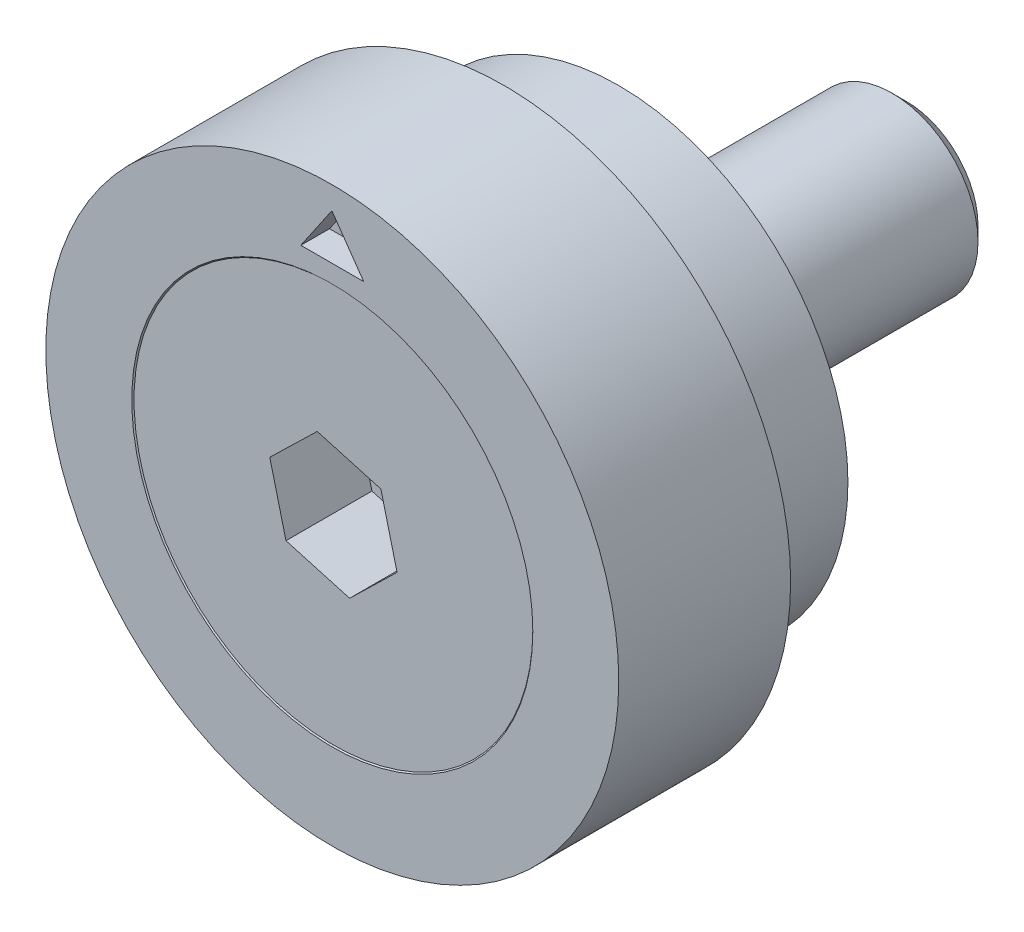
ISO-10303-21;
HEADER;
FILE_DESCRIPTION(('STEP AP214'),'2;1');
FILE_NAME('part.step','',(''),(''),'','','');
FILE_SCHEMA(('AUTOMOTIVE_DESIGN { 1 0 10303 214 1 1 1 1 }'));
ENDSEC;
DATA;
#1=APPLICATION_CONTEXT('core data for automotive mechanical design processes');
#2=APPLICATION_PROTOCOL_DEFINITION('international standard','automotive_design',2000,#1);
#3=PRODUCT_CONTEXT('',#1,'mechanical');
#4=PRODUCT('Part','Part','',(#3));
#5=PRODUCT_RELATED_PRODUCT_CATEGORY('part','',(#4));
#6=PRODUCT_DEFINITION_FORMATION('','',#4);
#7=PRODUCT_DEFINITION_CONTEXT('part definition',#1,'design');
#8=PRODUCT_DEFINITION('design','',#6,#7);
#9=PRODUCT_DEFINITION_SHAPE('','',#8);
#10=(LENGTH_UNIT() NAMED_UNIT(*) SI_UNIT(.MILLI.,.METRE.));
#11=(NAMED_UNIT(*) PLANE_ANGLE_UNIT() SI_UNIT($,.RADIAN.));
#12=(NAMED_UNIT(*) SI_UNIT($,.STERADIAN.) SOLID_ANGLE_UNIT());
#13=UNCERTAINTY_MEASURE_WITH_UNIT(LENGTH_MEASURE(1.E-05),#10,'distance_accuracy_value','');
#14=(GEOMETRIC_REPRESENTATION_CONTEXT(3) GLOBAL_UNCERTAINTY_ASSIGNED_CONTEXT((#13)) GLOBAL_UNIT_ASSIGNED_CONTEXT((#10,
#11,#12)) REPRESENTATION_CONTEXT('',''));
#15=CARTESIAN_POINT('',(0.,0.,0.));
#16=DIRECTION('',(0.,0.,1.));
#17=DIRECTION('',(1.,0.,0.));
#18=AXIS2_PLACEMENT_3D('',#15,#16,#17);
#19=CARTESIAN_POINT('',(0.,0.,-0.0200000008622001));
#20=DIRECTION('',(0.,0.,1.));
#21=DIRECTION('',(1.,0.,0.));
#22=AXIS2_PLACEMENT_3D('',#19,#20,#21);
#23=CYLINDRICAL_SURFACE('',#22,1.5);
#24=CARTESIAN_POINT('',(0.,0.,-2.0000000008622));
#25=DIRECTION('',(0.,0.,1.));
#26=DIRECTION('',(1.,0.,0.));
#27=AXIS2_PLACEMENT_3D('',#24,#25,#26);
#28=CIRCLE('',#27,1.5);
#29=CARTESIAN_POINT('',(1.5,0.,-2.0000000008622));
#30=VERTEX_POINT('',#29);
#31=EDGE_CURVE('P0_E11',#30,#30,#28,.T.);
#32=ORIENTED_EDGE('',*,*,#31,.F.);
#33=EDGE_LOOP('',(#32));
#34=FACE_BOUND('',#33,.T.);
#35=CARTESIAN_POINT('',(0.,0.,-9.7700000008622));
#36=DIRECTION('',(0.,0.,1.));
#37=DIRECTION('',(1.,0.,0.));
#38=AXIS2_PLACEMENT_3D('',#35,#36,#37);
#39=CIRCLE('',#38,1.5);
#40=CARTESIAN_POINT('',(1.5,0.,-9.7700000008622));
#41=VERTEX_POINT('',#40);
#42=EDGE_CURVE('P0_E136',#41,#41,#39,.T.);
#43=ORIENTED_EDGE('',*,*,#42,.T.);
#44=EDGE_LOOP('',(#43));
#45=FACE_BOUND('',#44,.T.);
#46=ADVANCED_FACE('P0_F35',(#34,#45),#23,.T.);
#47=CARTESIAN_POINT('',(0.,0.,-2.0000000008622));
#48=DIRECTION('',(0.,0.,1.));
#49=DIRECTION('',(1.,0.,0.));
#50=AXIS2_PLACEMENT_3D('',#47,#48,#49);
#51=CONICAL_SURFACE('',#50,1.5,0.785398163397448);
#52=CARTESIAN_POINT('',(0.,0.,-0.0200000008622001));
#53=DIRECTION('',(0.,0.,1.));
#54=DIRECTION('',(1.,0.,0.));
#55=AXIS2_PLACEMENT_3D('',#52,#53,#54);
#56=CIRCLE('',#55,3.48);
#57=CARTESIAN_POINT('',(3.48,0.,-0.0200000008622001));
#58=VERTEX_POINT('',#57);
#59=EDGE_CURVE('P0_E42',#58,#58,#56,.T.);
#60=ORIENTED_EDGE('',*,*,#59,.F.);
#61=EDGE_LOOP('',(#60));
#62=FACE_BOUND('',#61,.T.);
#63=ORIENTED_EDGE('',*,*,#31,.T.);
#64=EDGE_LOOP('',(#63));
#65=FACE_BOUND('',#64,.T.);
#66=ADVANCED_FACE('P0_F151',(#62,#65),#51,.T.);
#67=CARTESIAN_POINT('',(0.,3.48,-0.0200000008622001));
#68=DIRECTION('',(0.,0.,-1.));
#69=DIRECTION('',(-1.,0.,0.));
#70=AXIS2_PLACEMENT_3D('',#67,#68,#69);
#71=PLANE('',#70);
#72=DIRECTION('',(0.962144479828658,-0.272539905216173,0.));
#73=VECTOR('',#72,1.);
#74=CARTESIAN_POINT('',(-0.828034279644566,-0.804793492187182,-0.0200000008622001));
#75=LINE('',#74,#73);
#76=CARTESIAN_POINT('',(-0.828034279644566,-0.804793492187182,-0.0200000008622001));
#77=VERTEX_POINT('',#76);
#78=CARTESIAN_POINT('',(0.282954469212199,-1.11949546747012,-0.0200000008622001));
#79=VERTEX_POINT('',#78);
#80=EDGE_CURVE('P0_E123',#77,#79,#75,.T.);
#81=ORIENTED_EDGE('',*,*,#80,.F.);
#82=DIRECTION('',(0.245045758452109,-0.969511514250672,0.));
#83=VECTOR('',#82,1.);
#84=CARTESIAN_POINT('',(-1.11098874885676,0.314701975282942,-0.0200000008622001));
#85=LINE('',#84,#83);
#86=CARTESIAN_POINT('',(-1.11098874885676,0.314701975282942,-0.0200000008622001));
#87=VERTEX_POINT('',#86);
#88=EDGE_CURVE('P0_E49',#87,#77,#85,.T.);
#89=ORIENTED_EDGE('',*,*,#88,.F.);
#90=DIRECTION('',(-0.717098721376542,-0.696971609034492,0.));
#91=VECTOR('',#90,1.);
#92=CARTESIAN_POINT('',(-0.282954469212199,1.11949546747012,-0.0200000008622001));
#93=LINE('',#92,#91);
#94=CARTESIAN_POINT('',(-0.282954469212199,1.11949546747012,-0.0200000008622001));
#95=VERTEX_POINT('',#94);
#96=EDGE_CURVE('P0_E132',#95,#87,#93,.T.);
#97=ORIENTED_EDGE('',*,*,#96,.F.);
#98=DIRECTION('',(-0.962144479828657,0.272539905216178,0.));
#99=VECTOR('',#98,1.);
#100=CARTESIAN_POINT('',(0.828034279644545,0.804793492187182,-0.0200000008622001));
#101=LINE('',#100,#99);
#102=CARTESIAN_POINT('',(0.828034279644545,0.804793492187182,-0.0200000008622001));
#103=VERTEX_POINT('',#102);
#104=EDGE_CURVE('P0_E130',#103,#95,#101,.T.);
#105=ORIENTED_EDGE('',*,*,#104,.F.);
#106=DIRECTION('',(-0.245045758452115,0.96951151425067,0.));
#107=VECTOR('',#106,1.);
#108=CARTESIAN_POINT('',(1.11098874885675,-0.314701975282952,-0.0200000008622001));
#109=LINE('',#108,#107);
#110=CARTESIAN_POINT('',(1.11098874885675,-0.314701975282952,-0.0200000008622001));
#111=VERTEX_POINT('',#110);
#112=EDGE_CURVE('P0_E97',#111,#103,#109,.T.);
#113=ORIENTED_EDGE('',*,*,#112,.F.);
#114=DIRECTION('',(0.717098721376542,0.696971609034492,0.));
#115=VECTOR('',#114,1.);
#116=CARTESIAN_POINT('',(0.282954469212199,-1.11949546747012,-0.0200000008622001));
#117=LINE('',#116,#115);
#118=EDGE_CURVE('P0_E126',#79,#111,#117,.T.);
#119=ORIENTED_EDGE('',*,*,#118,.F.);
#120=EDGE_LOOP('',(#81,#89,#97,#105,#113,#119));
#121=FACE_BOUND('',#120,.T.);
#122=ORIENTED_EDGE('',*,*,#59,.T.);
#123=EDGE_LOOP('',(#122));
#124=FACE_BOUND('',#123,.T.);
#125=ADVANCED_FACE('P0_F149',(#121,#124),#71,.F.);
#126=CARTESIAN_POINT('',(0.,0.,-10.0200000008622));
#127=DIRECTION('',(0.,0.,1.));
#128=DIRECTION('',(1.,0.,0.));
#129=AXIS2_PLACEMENT_3D('',#126,#127,#128);
#130=PLANE('',#129);
#131=CARTESIAN_POINT('',(0.,0.,-10.0200000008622));
#132=DIRECTION('',(0.,0.,1.));
#133=DIRECTION('',(1.,0.,0.));
#134=AXIS2_PLACEMENT_3D('',#131,#132,#133);
#135=CIRCLE('',#134,1.25);
#136=CARTESIAN_POINT('',(1.25,0.,-10.0200000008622));
#137=VERTEX_POINT('',#136);
#138=EDGE_CURVE('P0_E144',#137,#137,#135,.T.);
#139=ORIENTED_EDGE('',*,*,#138,.F.);
#140=EDGE_LOOP('',(#139));
#141=FACE_BOUND('',#140,.T.);
#142=ADVANCED_FACE('P0_F164',(#141),#130,.F.);
#143=CARTESIAN_POINT('',(0.,0.,-10.0200000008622));
#144=DIRECTION('',(0.,0.,1.));
#145=DIRECTION('',(1.,0.,0.));
#146=AXIS2_PLACEMENT_3D('',#143,#144,#145);
#147=CONICAL_SURFACE('',#146,1.25,0.78539816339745);
#148=ORIENTED_EDGE('',*,*,#42,.F.);
#149=EDGE_LOOP('',(#148));
#150=FACE_BOUND('',#149,.T.);
#151=ORIENTED_EDGE('',*,*,#138,.T.);
#152=EDGE_LOOP('',(#151));
#153=FACE_BOUND('',#152,.T.);
#154=ADVANCED_FACE('P0_F160',(#150,#153),#147,.T.);
#155=CARTESIAN_POINT('',(-1.11098874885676,0.314701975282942,-1.5200000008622));
#156=DIRECTION('',(-0.969511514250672,-0.245045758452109,0.));
#157=DIRECTION('',(0.245045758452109,-0.969511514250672,0.));
#158=AXIS2_PLACEMENT_3D('',#155,#156,#157);
#159=PLANE('',#158);
#160=ORIENTED_EDGE('',*,*,#88,.T.);
#161=DIRECTION('',(0.,0.,1.));
#162=VECTOR('',#161,1.);
#163=CARTESIAN_POINT('',(-0.828034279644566,-0.804793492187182,-1.5200000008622));
#164=LINE('',#163,#162);
#165=CARTESIAN_POINT('',(-0.828034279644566,-0.804793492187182,-1.5200000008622));
#166=VERTEX_POINT('',#165);
#167=EDGE_CURVE('P0_E79',#166,#77,#164,.T.);
#168=ORIENTED_EDGE('',*,*,#167,.F.);
#169=DIRECTION('',(0.245045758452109,-0.969511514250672,0.));
#170=VECTOR('',#169,1.);
#171=CARTESIAN_POINT('',(-1.11098874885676,0.314701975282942,-1.5200000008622));
#172=LINE('',#171,#170);
#173=CARTESIAN_POINT('',(-1.11098874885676,0.314701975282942,-1.5200000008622));
#174=VERTEX_POINT('',#173);
#175=EDGE_CURVE('P0_E134',#174,#166,#172,.T.);
#176=ORIENTED_EDGE('',*,*,#175,.F.);
#177=DIRECTION('',(0.,0.,1.));
#178=VECTOR('',#177,1.);
#179=CARTESIAN_POINT('',(-1.11098874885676,0.314701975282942,-1.5200000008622));
#180=LINE('',#179,#178);
#181=EDGE_CURVE('P0_E57',#174,#87,#180,.T.);
#182=ORIENTED_EDGE('',*,*,#181,.T.);
#183=EDGE_LOOP('',(#160,#168,#176,#182));
#184=FACE_BOUND('',#183,.T.);
#185=ADVANCED_FACE('P0_F163',(#184),#159,.F.);
#186=CARTESIAN_POINT('',(-0.282954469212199,1.11949546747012,-1.5200000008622));
#187=DIRECTION('',(-0.696971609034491,0.717098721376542,0.));
#188=DIRECTION('',(-0.717098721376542,-0.696971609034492,0.));
#189=AXIS2_PLACEMENT_3D('',#186,#187,#188);
#190=PLANE('',#189);
#191=ORIENTED_EDGE('',*,*,#96,.T.);
#192=ORIENTED_EDGE('',*,*,#181,.F.);
#193=DIRECTION('',(-0.717098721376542,-0.696971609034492,0.));
#194=VECTOR('',#193,1.);
#195=CARTESIAN_POINT('',(-0.282954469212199,1.11949546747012,-1.5200000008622));
#196=LINE('',#195,#194);
#197=CARTESIAN_POINT('',(-0.282954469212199,1.11949546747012,-1.5200000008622));
#198=VERTEX_POINT('',#197);
#199=EDGE_CURVE('P0_E109',#198,#174,#196,.T.);
#200=ORIENTED_EDGE('',*,*,#199,.F.);
#201=DIRECTION('',(0.,0.,1.));
#202=VECTOR('',#201,1.);
#203=CARTESIAN_POINT('',(-0.282954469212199,1.11949546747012,-1.5200000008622));
#204=LINE('',#203,#202);
#205=EDGE_CURVE('P0_E101',#198,#95,#204,.T.);
#206=ORIENTED_EDGE('',*,*,#205,.T.);
#207=EDGE_LOOP('',(#191,#192,#200,#206));
#208=FACE_BOUND('',#207,.T.);
#209=ADVANCED_FACE('P0_F178',(#208),#190,.F.);
#210=CARTESIAN_POINT('',(0.828034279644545,0.804793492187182,-1.5200000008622));
#211=DIRECTION('',(0.272539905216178,0.962144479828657,0.));
#212=DIRECTION('',(-0.962144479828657,0.272539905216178,0.));
#213=AXIS2_PLACEMENT_3D('',#210,#211,#212);
#214=PLANE('',#213);
#215=ORIENTED_EDGE('',*,*,#104,.T.);
#216=ORIENTED_EDGE('',*,*,#205,.F.);
#217=DIRECTION('',(-0.962144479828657,0.272539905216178,0.));
#218=VECTOR('',#217,1.);
#219=CARTESIAN_POINT('',(0.828034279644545,0.804793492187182,-1.5200000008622));
#220=LINE('',#219,#218);
#221=CARTESIAN_POINT('',(0.828034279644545,0.804793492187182,-1.5200000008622));
#222=VERTEX_POINT('',#221);
#223=EDGE_CURVE('P0_E105',#222,#198,#220,.T.);
#224=ORIENTED_EDGE('',*,*,#223,.F.);
#225=DIRECTION('',(0.,0.,1.));
#226=VECTOR('',#225,1.);
#227=CARTESIAN_POINT('',(0.828034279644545,0.804793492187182,-1.5200000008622));
#228=LINE('',#227,#226);
#229=EDGE_CURVE('P0_E90',#222,#103,#228,.T.);
#230=ORIENTED_EDGE('',*,*,#229,.T.);
#231=EDGE_LOOP('',(#215,#216,#224,#230));
#232=FACE_BOUND('',#231,.T.);
#233=ADVANCED_FACE('P0_F106',(#232),#214,.F.);
#234=CARTESIAN_POINT('',(1.11098874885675,-0.314701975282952,-1.5200000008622));
#235=DIRECTION('',(0.96951151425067,0.245045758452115,0.));
#236=DIRECTION('',(-0.245045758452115,0.96951151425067,0.));
#237=AXIS2_PLACEMENT_3D('',#234,#235,#236);
#238=PLANE('',#237);
#239=ORIENTED_EDGE('',*,*,#112,.T.);
#240=ORIENTED_EDGE('',*,*,#229,.F.);
#241=DIRECTION('',(-0.245045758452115,0.96951151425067,0.));
#242=VECTOR('',#241,1.);
#243=CARTESIAN_POINT('',(1.11098874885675,-0.314701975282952,-1.5200000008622));
#244=LINE('',#243,#242);
#245=CARTESIAN_POINT('',(1.11098874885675,-0.314701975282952,-1.5200000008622));
#246=VERTEX_POINT('',#245);
#247=EDGE_CURVE('P0_E94',#246,#222,#244,.T.);
#248=ORIENTED_EDGE('',*,*,#247,.F.);
#249=DIRECTION('',(0.,0.,1.));
#250=VECTOR('',#249,1.);
#251=CARTESIAN_POINT('',(1.11098874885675,-0.314701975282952,-1.5200000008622));
#252=LINE('',#251,#250);
#253=EDGE_CURVE('P0_E102',#246,#111,#252,.T.);
#254=ORIENTED_EDGE('',*,*,#253,.T.);
#255=EDGE_LOOP('',(#239,#240,#248,#254));
#256=FACE_BOUND('',#255,.T.);
#257=ADVANCED_FACE('P0_F92',(#256),#238,.F.);
#258=CARTESIAN_POINT('',(0.282954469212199,-1.11949546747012,-1.5200000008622));
#259=DIRECTION('',(0.696971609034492,-0.717098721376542,0.));
#260=DIRECTION('',(0.717098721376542,0.696971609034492,0.));
#261=AXIS2_PLACEMENT_3D('',#258,#259,#260);
#262=PLANE('',#261);
#263=ORIENTED_EDGE('',*,*,#118,.T.);
#264=ORIENTED_EDGE('',*,*,#253,.F.);
#265=DIRECTION('',(0.717098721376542,0.696971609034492,0.));
#266=VECTOR('',#265,1.);
#267=CARTESIAN_POINT('',(0.282954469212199,-1.11949546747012,-1.5200000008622));
#268=LINE('',#267,#266);
#269=CARTESIAN_POINT('',(0.282954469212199,-1.11949546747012,-1.5200000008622));
#270=VERTEX_POINT('',#269);
#271=EDGE_CURVE('P0_E115',#270,#246,#268,.T.);
#272=ORIENTED_EDGE('',*,*,#271,.F.);
#273=DIRECTION('',(0.,0.,1.));
#274=VECTOR('',#273,1.);
#275=CARTESIAN_POINT('',(0.282954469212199,-1.11949546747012,-1.5200000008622));
#276=LINE('',#275,#274);
#277=EDGE_CURVE('P0_E139',#270,#79,#276,.T.);
#278=ORIENTED_EDGE('',*,*,#277,.T.);
#279=EDGE_LOOP('',(#263,#264,#272,#278));
#280=FACE_BOUND('',#279,.T.);
#281=ADVANCED_FACE('P0_F182',(#280),#262,.F.);
#282=CARTESIAN_POINT('',(-0.828034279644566,-0.804793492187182,-1.5200000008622));
#283=DIRECTION('',(-0.272539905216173,-0.962144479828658,0.));
#284=DIRECTION('',(0.962144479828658,-0.272539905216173,0.));
#285=AXIS2_PLACEMENT_3D('',#282,#283,#284);
#286=PLANE('',#285);
#287=ORIENTED_EDGE('',*,*,#80,.T.);
#288=ORIENTED_EDGE('',*,*,#277,.F.);
#289=DIRECTION('',(0.962144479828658,-0.272539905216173,0.));
#290=VECTOR('',#289,1.);
#291=CARTESIAN_POINT('',(-0.828034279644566,-0.804793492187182,-1.5200000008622));
#292=LINE('',#291,#290);
#293=EDGE_CURVE('P0_E117',#166,#270,#292,.T.);
#294=ORIENTED_EDGE('',*,*,#293,.F.);
#295=ORIENTED_EDGE('',*,*,#167,.T.);
#296=EDGE_LOOP('',(#287,#288,#294,#295));
#297=FACE_BOUND('',#296,.T.);
#298=ADVANCED_FACE('P0_F179',(#297),#286,.F.);
#299=CARTESIAN_POINT('',(0.,0.,-1.5200000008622));
#300=DIRECTION('',(0.,0.,1.));
#301=DIRECTION('',(1.,0.,0.));
#302=AXIS2_PLACEMENT_3D('',#299,#300,#301);
#303=PLANE('',#302);
#304=ORIENTED_EDGE('',*,*,#175,.T.);
#305=ORIENTED_EDGE('',*,*,#293,.T.);
#306=ORIENTED_EDGE('',*,*,#271,.T.);
#307=ORIENTED_EDGE('',*,*,#247,.T.);
#308=ORIENTED_EDGE('',*,*,#223,.T.);
#309=ORIENTED_EDGE('',*,*,#199,.T.);
#310=EDGE_LOOP('',(#304,#305,#306,#307,#308,#309));
#311=FACE_BOUND('',#310,.T.);
#312=ADVANCED_FACE('P0_F112',(#311),#303,.T.);
#313=CLOSED_SHELL('',(#46,#66,#125,#142,#154,#185,#209,#233,#257,#281,#298,#312));
#314=MANIFOLD_SOLID_BREP('P0_B2',#313);
#315=CARTESIAN_POINT('',(0.,0.,3.12219627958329));
#316=DIRECTION('',(0.,0.,1.));
#317=DIRECTION('',(1.,0.,0.));
#318=AXIS2_PLACEMENT_3D('',#315,#316,#317);
#319=CYLINDRICAL_SURFACE('',#318,5.);
#320=CARTESIAN_POINT('',(0.,0.,0.));
#321=DIRECTION('',(0.,0.,1.));
#322=DIRECTION('',(1.,0.,0.));
#323=AXIS2_PLACEMENT_3D('',#320,#321,#322);
#324=CIRCLE('',#323,5.);
#325=CARTESIAN_POINT('',(5.,0.,0.));
#326=VERTEX_POINT('',#325);
#327=EDGE_CURVE('P1_E11',#326,#326,#324,.T.);
#328=ORIENTED_EDGE('',*,*,#327,.F.);
#329=EDGE_LOOP('',(#328));
#330=FACE_BOUND('',#329,.T.);
#331=CARTESIAN_POINT('',(0.,0.,-3.));
#332=DIRECTION('',(0.,0.,1.));
#333=DIRECTION('',(1.,0.,0.));
#334=AXIS2_PLACEMENT_3D('',#331,#332,#333);
#335=CIRCLE('',#334,5.);
#336=CARTESIAN_POINT('',(5.,0.,-3.));
#337=VERTEX_POINT('',#336);
#338=EDGE_CURVE('P1_E75',#337,#337,#335,.T.);
#339=ORIENTED_EDGE('',*,*,#338,.T.);
#340=EDGE_LOOP('',(#339));
#341=FACE_BOUND('',#340,.T.);
#342=ADVANCED_FACE('P1_F16',(#330,#341),#319,.T.);
#343=CARTESIAN_POINT('',(0.,5.,0.));
#344=DIRECTION('',(0.,0.,-1.));
#345=DIRECTION('',(-1.,0.,0.));
#346=AXIS2_PLACEMENT_3D('',#343,#344,#345);
#347=PLANE('',#346);
#348=DIRECTION('',(-0.573576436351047,0.819152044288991,0.));
#349=VECTOR('',#348,1.);
#350=CARTESIAN_POINT('',(0.548658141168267,3.81,0.));
#351=LINE('',#350,#349);
#352=CARTESIAN_POINT('',(0.548658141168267,3.81,0.));
#353=VERTEX_POINT('',#352);
#354=CARTESIAN_POINT('',(-0.00713159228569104,4.60375,0.));
#355=VERTEX_POINT('',#354);
#356=EDGE_CURVE('P1_E68',#353,#355,#351,.T.);
#357=ORIENTED_EDGE('',*,*,#356,.F.);
#358=DIRECTION('',(1.,0.,0.));
#359=VECTOR('',#358,1.);
#360=CARTESIAN_POINT('',(-0.548658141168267,3.81,0.));
#361=LINE('',#360,#359);
#362=CARTESIAN_POINT('',(-0.548658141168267,3.81,0.));
#363=VERTEX_POINT('',#362);
#364=EDGE_CURVE('P1_E30',#363,#353,#361,.T.);
#365=ORIENTED_EDGE('',*,*,#364,.F.);
#366=DIRECTION('',(-0.563573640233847,-0.826065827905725,0.));
#367=VECTOR('',#366,1.);
#368=CARTESIAN_POINT('',(-0.00713159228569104,4.60375,0.));
#369=LINE('',#368,#367);
#370=EDGE_CURVE('P1_E66',#355,#363,#369,.T.);
#371=ORIENTED_EDGE('',*,*,#370,.F.);
#372=EDGE_LOOP('',(#357,#365,#371));
#373=FACE_BOUND('',#372,.T.);
#374=CARTESIAN_POINT('',(0.,0.,0.));
#375=DIRECTION('',(0.,0.,1.));
#376=DIRECTION('',(1.,0.,0.));
#377=AXIS2_PLACEMENT_3D('',#374,#375,#376);
#378=CIRCLE('',#377,3.5000000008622);
#379=CARTESIAN_POINT('',(3.5000000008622,0.,0.));
#380=VERTEX_POINT('',#379);
#381=EDGE_CURVE('P1_E23',#380,#380,#378,.T.);
#382=ORIENTED_EDGE('',*,*,#381,.F.);
#383=EDGE_LOOP('',(#382));
#384=FACE_BOUND('',#383,.T.);
#385=ORIENTED_EDGE('',*,*,#327,.T.);
#386=EDGE_LOOP('',(#385));
#387=FACE_BOUND('',#386,.T.);
#388=ADVANCED_FACE('P1_F95',(#373,#384,#387),#347,.F.);
#389=CARTESIAN_POINT('',(0.,0.,0.));
#390=DIRECTION('',(0.,0.,1.));
#391=DIRECTION('',(1.,0.,0.));
#392=AXIS2_PLACEMENT_3D('',#389,#390,#391);
#393=CONICAL_SURFACE('',#392,3.5000000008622,0.785398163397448);
#394=CARTESIAN_POINT('',(0.,0.,-2.0000000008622));
#395=DIRECTION('',(0.,0.,1.));
#396=DIRECTION('',(1.,0.,0.));
#397=AXIS2_PLACEMENT_3D('',#394,#395,#396);
#398=CIRCLE('',#397,1.5);
#399=CARTESIAN_POINT('',(1.5,0.,-2.0000000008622));
#400=VERTEX_POINT('',#399);
#401=EDGE_CURVE('P1_E88',#400,#400,#398,.T.);
#402=ORIENTED_EDGE('',*,*,#401,.F.);
#403=EDGE_LOOP('',(#402));
#404=FACE_BOUND('',#403,.T.);
#405=ORIENTED_EDGE('',*,*,#381,.T.);
#406=EDGE_LOOP('',(#405));
#407=FACE_BOUND('',#406,.T.);
#408=ADVANCED_FACE('P1_F93',(#404,#407),#393,.F.);
#409=CARTESIAN_POINT('',(0.,0.,3.12219627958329));
#410=DIRECTION('',(0.,0.,1.));
#411=DIRECTION('',(1.,0.,0.));
#412=AXIS2_PLACEMENT_3D('',#409,#410,#411);
#413=CYLINDRICAL_SURFACE('',#412,1.5);
#414=CARTESIAN_POINT('',(0.,0.,-5.));
#415=DIRECTION('',(0.,0.,1.));
#416=DIRECTION('',(1.,0.,0.));
#417=AXIS2_PLACEMENT_3D('',#414,#415,#416);
#418=CIRCLE('',#417,1.5);
#419=CARTESIAN_POINT('',(1.5,0.,-5.));
#420=VERTEX_POINT('',#419);
#421=EDGE_CURVE('P1_E85',#420,#420,#418,.T.);
#422=ORIENTED_EDGE('',*,*,#421,.F.);
#423=EDGE_LOOP('',(#422));
#424=FACE_BOUND('',#423,.T.);
#425=ORIENTED_EDGE('',*,*,#401,.T.);
#426=EDGE_LOOP('',(#425));
#427=FACE_BOUND('',#426,.T.);
#428=ADVANCED_FACE('P1_F120',(#424,#427),#413,.F.);
#429=CARTESIAN_POINT('',(0.,1.5,-5.));
#430=DIRECTION('',(0.,0.,1.));
#431=DIRECTION('',(1.,0.,0.));
#432=AXIS2_PLACEMENT_3D('',#429,#430,#431);
#433=PLANE('',#432);
#434=CARTESIAN_POINT('',(0.,0.,-5.));
#435=DIRECTION('',(0.,0.,1.));
#436=DIRECTION('',(1.,0.,0.));
#437=AXIS2_PLACEMENT_3D('',#434,#435,#436);
#438=CIRCLE('',#437,4.);
#439=CARTESIAN_POINT('',(4.,0.,-5.));
#440=VERTEX_POINT('',#439);
#441=EDGE_CURVE('P1_E82',#440,#440,#438,.T.);
#442=ORIENTED_EDGE('',*,*,#441,.F.);
#443=EDGE_LOOP('',(#442));
#444=FACE_BOUND('',#443,.T.);
#445=ORIENTED_EDGE('',*,*,#421,.T.);
#446=EDGE_LOOP('',(#445));
#447=FACE_BOUND('',#446,.T.);
#448=ADVANCED_FACE('P1_F114',(#444,#447),#433,.F.);
#449=CARTESIAN_POINT('',(0.,0.,3.12219627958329));
#450=DIRECTION('',(0.,0.,1.));
#451=DIRECTION('',(1.,0.,0.));
#452=AXIS2_PLACEMENT_3D('',#449,#450,#451);
#453=CYLINDRICAL_SURFACE('',#452,4.);
#454=CARTESIAN_POINT('',(0.,0.,-3.));
#455=DIRECTION('',(0.,0.,1.));
#456=DIRECTION('',(1.,0.,0.));
#457=AXIS2_PLACEMENT_3D('',#454,#455,#456);
#458=CIRCLE('',#457,4.);
#459=CARTESIAN_POINT('',(4.,0.,-3.));
#460=VERTEX_POINT('',#459);
#461=EDGE_CURVE('P1_E79',#460,#460,#458,.T.);
#462=ORIENTED_EDGE('',*,*,#461,.F.);
#463=EDGE_LOOP('',(#462));
#464=FACE_BOUND('',#463,.T.);
#465=ORIENTED_EDGE('',*,*,#441,.T.);
#466=EDGE_LOOP('',(#465));
#467=FACE_BOUND('',#466,.T.);
#468=ADVANCED_FACE('P1_F108',(#464,#467),#453,.T.);
#469=CARTESIAN_POINT('',(0.,4.,-3.));
#470=DIRECTION('',(0.,0.,1.));
#471=DIRECTION('',(1.,0.,0.));
#472=AXIS2_PLACEMENT_3D('',#469,#470,#471);
#473=PLANE('',#472);
#474=ORIENTED_EDGE('',*,*,#338,.F.);
#475=EDGE_LOOP('',(#474));
#476=FACE_BOUND('',#475,.T.);
#477=ORIENTED_EDGE('',*,*,#461,.T.);
#478=EDGE_LOOP('',(#477));
#479=FACE_BOUND('',#478,.T.);
#480=ADVANCED_FACE('P1_F105',(#476,#479),#473,.F.);
#481=CARTESIAN_POINT('',(-0.548658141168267,3.81,-0.5));
#482=DIRECTION('',(0.,-1.,0.));
#483=DIRECTION('',(0.,0.,-1.));
#484=AXIS2_PLACEMENT_3D('',#481,#482,#483);
#485=PLANE('',#484);
#486=ORIENTED_EDGE('',*,*,#364,.T.);
#487=DIRECTION('',(0.,0.,1.));
#488=VECTOR('',#487,1.);
#489=CARTESIAN_POINT('',(0.548658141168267,3.81,-0.5));
#490=LINE('',#489,#488);
#491=CARTESIAN_POINT('',(0.548658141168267,3.81,-0.5));
#492=VERTEX_POINT('',#491);
#493=EDGE_CURVE('P1_E48',#492,#353,#490,.T.);
#494=ORIENTED_EDGE('',*,*,#493,.F.);
#495=DIRECTION('',(1.,0.,0.));
#496=VECTOR('',#495,1.);
#497=CARTESIAN_POINT('',(-0.548658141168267,3.81,-0.5));
#498=LINE('',#497,#496);
#499=CARTESIAN_POINT('',(-0.548658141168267,3.81,-0.5));
#500=VERTEX_POINT('',#499);
#501=EDGE_CURVE('P1_E52',#500,#492,#498,.T.);
#502=ORIENTED_EDGE('',*,*,#501,.F.);
#503=DIRECTION('',(0.,0.,1.));
#504=VECTOR('',#503,1.);
#505=CARTESIAN_POINT('',(-0.548658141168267,3.81,-0.5));
#506=LINE('',#505,#504);
#507=EDGE_CURVE('P1_E38',#500,#363,#506,.T.);
#508=ORIENTED_EDGE('',*,*,#507,.T.);
#509=EDGE_LOOP('',(#486,#494,#502,#508));
#510=FACE_BOUND('',#509,.T.);
#511=ADVANCED_FACE('P1_F50',(#510),#485,.F.);
#512=CARTESIAN_POINT('',(-0.00713159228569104,4.60375,-0.5));
#513=DIRECTION('',(-0.826065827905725,0.563573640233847,0.));
#514=DIRECTION('',(-0.563573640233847,-0.826065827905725,0.));
#515=AXIS2_PLACEMENT_3D('',#512,#513,#514);
#516=PLANE('',#515);
#517=ORIENTED_EDGE('',*,*,#370,.T.);
#518=ORIENTED_EDGE('',*,*,#507,.F.);
#519=DIRECTION('',(-0.563573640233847,-0.826065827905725,0.));
#520=VECTOR('',#519,1.);
#521=CARTESIAN_POINT('',(-0.00713159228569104,4.60375,-0.5));
#522=LINE('',#521,#520);
#523=CARTESIAN_POINT('',(-0.00713159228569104,4.60375,-0.5));
#524=VERTEX_POINT('',#523);
#525=EDGE_CURVE('P1_E58',#524,#500,#522,.T.);
#526=ORIENTED_EDGE('',*,*,#525,.F.);
#527=DIRECTION('',(0.,0.,1.));
#528=VECTOR('',#527,1.);
#529=CARTESIAN_POINT('',(-0.00713159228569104,4.60375,-0.5));
#530=LINE('',#529,#528);
#531=EDGE_CURVE('P1_E57',#524,#355,#530,.T.);
#532=ORIENTED_EDGE('',*,*,#531,.T.);
#533=EDGE_LOOP('',(#517,#518,#526,#532));
#534=FACE_BOUND('',#533,.T.);
#535=ADVANCED_FACE('P1_F138',(#534),#516,.F.);
#536=CARTESIAN_POINT('',(0.548658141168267,3.81,-0.5));
#537=DIRECTION('',(0.819152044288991,0.573576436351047,0.));
#538=DIRECTION('',(-0.573576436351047,0.819152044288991,0.));
#539=AXIS2_PLACEMENT_3D('',#536,#537,#538);
#540=PLANE('',#539);
#541=ORIENTED_EDGE('',*,*,#356,.T.);
#542=ORIENTED_EDGE('',*,*,#531,.F.);
#543=DIRECTION('',(-0.573576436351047,0.819152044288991,0.));
#544=VECTOR('',#543,1.);
#545=CARTESIAN_POINT('',(0.548658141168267,3.81,-0.5));
#546=LINE('',#545,#544);
#547=EDGE_CURVE('P1_E61',#492,#524,#546,.T.);
#548=ORIENTED_EDGE('',*,*,#547,.F.);
#549=ORIENTED_EDGE('',*,*,#493,.T.);
#550=EDGE_LOOP('',(#541,#542,#548,#549));
#551=FACE_BOUND('',#550,.T.);
#552=ADVANCED_FACE('P1_F62',(#551),#540,.F.);
#553=CARTESIAN_POINT('',(-0.548658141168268,3.81,-0.5));
#554=DIRECTION('',(0.,0.,-1.));
#555=DIRECTION('',(-1.,0.,0.));
#556=AXIS2_PLACEMENT_3D('',#553,#554,#555);
#557=PLANE('',#556);
#558=ORIENTED_EDGE('',*,*,#501,.T.);
#559=ORIENTED_EDGE('',*,*,#547,.T.);
#560=ORIENTED_EDGE('',*,*,#525,.T.);
#561=EDGE_LOOP('',(#558,#559,#560));
#562=FACE_BOUND('',#561,.T.);
#563=ADVANCED_FACE('P1_F65',(#562),#557,.F.);
#564=CLOSED_SHELL('',(#342,#388,#408,#428,#448,#468,#480,#511,#535,#552,#563));
#565=MANIFOLD_SOLID_BREP('P1_B1',#564);
#566=ADVANCED_BREP_SHAPE_REPRESENTATION('',(#18,#314,#565),#14);
#567=SHAPE_DEFINITION_REPRESENTATION(#9,#566);
ENDSEC;
END-ISO-10303-21;
